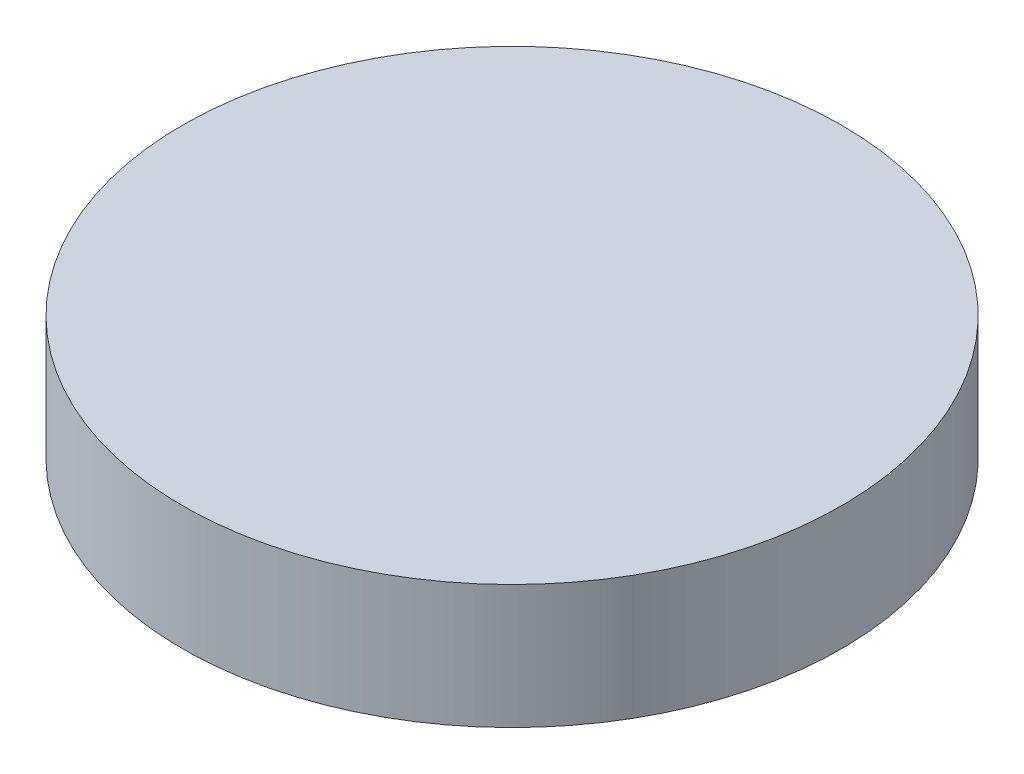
from build123d import *

# Parameters (mm, degrees)
SKETCH3_R           = 50.673
BOSS_EXTRUDE1_DEPTH = 19.05
SKETCH4_W           = 13.208
SKETCH4_H           = 11.176
CUT_EXTRUDE1_DEPTH  = 12.7


with BuildPart() as part:
    # Sketch3 → Boss-Extrude1 (new body)
    with BuildSketch(Plane(origin=(0, 0, 0), x_dir=(1, 0, 0), z_dir=(0, 1, 0))):
        with Locations(Location((0, 0, 0), (0, 0, 90))):
            Circle(SKETCH3_R)
    extrude(amount=BOSS_EXTRUDE1_DEPTH)

    # Sketch4 → Cut-Extrude1 (cut)
    with BuildSketch(Plane.XZ):
        Rectangle(SKETCH4_W, SKETCH4_H)
    extrude(amount=-CUT_EXTRUDE1_DEPTH, mode=Mode.SUBTRACT)


solid = part.part
